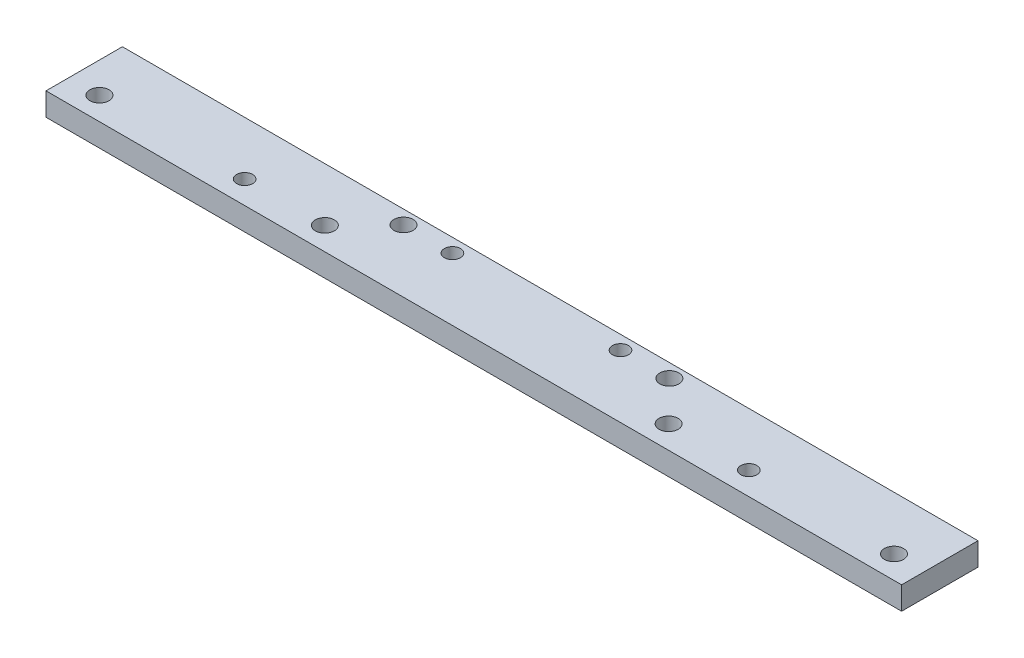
ISO-10303-21;
HEADER;
FILE_DESCRIPTION(('STEP AP214'),'2;1');
FILE_NAME('part.step','',(''),(''),'','','');
FILE_SCHEMA(('AUTOMOTIVE_DESIGN { 1 0 10303 214 1 1 1 1 }'));
ENDSEC;
DATA;
#1=APPLICATION_CONTEXT('core data for automotive mechanical design processes');
#2=APPLICATION_PROTOCOL_DEFINITION('international standard','automotive_design',2000,#1);
#3=PRODUCT_CONTEXT('',#1,'mechanical');
#4=PRODUCT('Part','Part','',(#3));
#5=PRODUCT_RELATED_PRODUCT_CATEGORY('part','',(#4));
#6=PRODUCT_DEFINITION_FORMATION('','',#4);
#7=PRODUCT_DEFINITION_CONTEXT('part definition',#1,'design');
#8=PRODUCT_DEFINITION('design','',#6,#7);
#9=PRODUCT_DEFINITION_SHAPE('','',#8);
#10=(LENGTH_UNIT() NAMED_UNIT(*) SI_UNIT(.MILLI.,.METRE.));
#11=(NAMED_UNIT(*) PLANE_ANGLE_UNIT() SI_UNIT($,.RADIAN.));
#12=(NAMED_UNIT(*) SI_UNIT($,.STERADIAN.) SOLID_ANGLE_UNIT());
#13=UNCERTAINTY_MEASURE_WITH_UNIT(LENGTH_MEASURE(1.E-05),#10,'distance_accuracy_value','');
#14=(GEOMETRIC_REPRESENTATION_CONTEXT(3) GLOBAL_UNCERTAINTY_ASSIGNED_CONTEXT((#13)) GLOBAL_UNIT_ASSIGNED_CONTEXT((#10,
#11,#12)) REPRESENTATION_CONTEXT('',''));
#15=CARTESIAN_POINT('',(0.,0.,0.));
#16=DIRECTION('',(0.,0.,1.));
#17=DIRECTION('',(1.,0.,0.));
#18=AXIS2_PLACEMENT_3D('',#15,#16,#17);
#19=CARTESIAN_POINT('',(280.,15.,25.));
#20=DIRECTION('',(0.,0.,-1.));
#21=DIRECTION('',(0.,1.,0.));
#22=AXIS2_PLACEMENT_3D('',#19,#20,#21);
#23=PLANE('',#22);
#24=DIRECTION('',(0.,-1.,0.));
#25=VECTOR('',#24,1.);
#26=CARTESIAN_POINT('',(-280.,15.,25.));
#27=LINE('',#26,#25);
#28=CARTESIAN_POINT('',(-280.,15.,25.));
#29=VERTEX_POINT('',#28);
#30=CARTESIAN_POINT('',(-280.,0.,25.));
#31=VERTEX_POINT('',#30);
#32=EDGE_CURVE('E83',#29,#31,#27,.T.);
#33=ORIENTED_EDGE('',*,*,#32,.T.);
#34=DIRECTION('',(-1.,0.,0.));
#35=VECTOR('',#34,1.);
#36=CARTESIAN_POINT('',(280.,0.,25.));
#37=LINE('',#36,#35);
#38=CARTESIAN_POINT('',(280.,0.,25.));
#39=VERTEX_POINT('',#38);
#40=EDGE_CURVE('E11',#39,#31,#37,.T.);
#41=ORIENTED_EDGE('',*,*,#40,.F.);
#42=DIRECTION('',(0.,-1.,0.));
#43=VECTOR('',#42,1.);
#44=CARTESIAN_POINT('',(280.,15.,25.));
#45=LINE('',#44,#43);
#46=CARTESIAN_POINT('',(280.,15.,25.));
#47=VERTEX_POINT('',#46);
#48=EDGE_CURVE('E113',#47,#39,#45,.T.);
#49=ORIENTED_EDGE('',*,*,#48,.F.);
#50=DIRECTION('',(-1.,0.,0.));
#51=VECTOR('',#50,1.);
#52=CARTESIAN_POINT('',(280.,15.,25.));
#53=LINE('',#52,#51);
#54=EDGE_CURVE('E96',#47,#29,#53,.T.);
#55=ORIENTED_EDGE('',*,*,#54,.T.);
#56=EDGE_LOOP('',(#33,#41,#49,#55));
#57=FACE_BOUND('',#56,.T.);
#58=ADVANCED_FACE('F38',(#57),#23,.F.);
#59=CARTESIAN_POINT('',(280.,0.,25.));
#60=DIRECTION('',(0.,1.,0.));
#61=DIRECTION('',(0.,0.,1.));
#62=AXIS2_PLACEMENT_3D('',#59,#60,#61);
#63=PLANE('',#62);
#64=CARTESIAN_POINT('',(-260.,0.,10.));
#65=DIRECTION('',(0.,1.,0.));
#66=DIRECTION('',(0.,0.,1.));
#67=AXIS2_PLACEMENT_3D('',#64,#65,#66);
#68=CIRCLE('',#67,6.25);
#69=CARTESIAN_POINT('',(-260.,0.,16.25));
#70=VERTEX_POINT('',#69);
#71=EDGE_CURVE('E155',#70,#70,#68,.F.);
#72=ORIENTED_EDGE('',*,*,#71,.F.);
#73=EDGE_LOOP('',(#72));
#74=FACE_BOUND('',#73,.T.);
#75=CARTESIAN_POINT('',(260.,0.,10.));
#76=DIRECTION('',(0.,1.,0.));
#77=DIRECTION('',(0.,0.,1.));
#78=AXIS2_PLACEMENT_3D('',#75,#76,#77);
#79=CIRCLE('',#78,6.25);
#80=CARTESIAN_POINT('',(260.,0.,16.25));
#81=VERTEX_POINT('',#80);
#82=EDGE_CURVE('E159',#81,#81,#79,.F.);
#83=ORIENTED_EDGE('',*,*,#82,.F.);
#84=EDGE_LOOP('',(#83));
#85=FACE_BOUND('',#84,.T.);
#86=CARTESIAN_POINT('',(-165.,0.,10.));
#87=DIRECTION('',(0.,1.,0.));
#88=DIRECTION('',(0.,0.,1.));
#89=AXIS2_PLACEMENT_3D('',#86,#87,#88);
#90=CIRCLE('',#89,5.25);
#91=CARTESIAN_POINT('',(-165.,0.,15.25));
#92=VERTEX_POINT('',#91);
#93=EDGE_CURVE('E163',#92,#92,#90,.F.);
#94=ORIENTED_EDGE('',*,*,#93,.F.);
#95=EDGE_LOOP('',(#94));
#96=FACE_BOUND('',#95,.T.);
#97=CARTESIAN_POINT('',(165.,0.,10.));
#98=DIRECTION('',(0.,1.,0.));
#99=DIRECTION('',(0.,0.,1.));
#100=AXIS2_PLACEMENT_3D('',#97,#98,#99);
#101=CIRCLE('',#100,5.25);
#102=CARTESIAN_POINT('',(165.,0.,15.25));
#103=VERTEX_POINT('',#102);
#104=EDGE_CURVE('E167',#103,#103,#101,.F.);
#105=ORIENTED_EDGE('',*,*,#104,.F.);
#106=EDGE_LOOP('',(#105));
#107=FACE_BOUND('',#106,.T.);
#108=CARTESIAN_POINT('',(-112.5,0.,10.));
#109=DIRECTION('',(0.,1.,0.));
#110=DIRECTION('',(0.,0.,1.));
#111=AXIS2_PLACEMENT_3D('',#108,#109,#110);
#112=CIRCLE('',#111,6.25);
#113=CARTESIAN_POINT('',(-112.5,0.,16.25));
#114=VERTEX_POINT('',#113);
#115=EDGE_CURVE('E171',#114,#114,#112,.F.);
#116=ORIENTED_EDGE('',*,*,#115,.F.);
#117=EDGE_LOOP('',(#116));
#118=FACE_BOUND('',#117,.T.);
#119=CARTESIAN_POINT('',(112.5,0.,10.));
#120=DIRECTION('',(0.,1.,0.));
#121=DIRECTION('',(0.,0.,1.));
#122=AXIS2_PLACEMENT_3D('',#119,#120,#121);
#123=CIRCLE('',#122,6.25);
#124=CARTESIAN_POINT('',(112.5,0.,16.25));
#125=VERTEX_POINT('',#124);
#126=EDGE_CURVE('E175',#125,#125,#123,.F.);
#127=ORIENTED_EDGE('',*,*,#126,.F.);
#128=EDGE_LOOP('',(#127));
#129=FACE_BOUND('',#128,.T.);
#130=CARTESIAN_POINT('',(-87.,0.,-16.));
#131=DIRECTION('',(0.,1.,0.));
#132=DIRECTION('',(0.,0.,1.));
#133=AXIS2_PLACEMENT_3D('',#130,#131,#132);
#134=CIRCLE('',#133,6.25);
#135=CARTESIAN_POINT('',(-87.,0.,-9.75));
#136=VERTEX_POINT('',#135);
#137=EDGE_CURVE('E179',#136,#136,#134,.F.);
#138=ORIENTED_EDGE('',*,*,#137,.F.);
#139=EDGE_LOOP('',(#138));
#140=FACE_BOUND('',#139,.T.);
#141=CARTESIAN_POINT('',(87.,0.,-16.));
#142=DIRECTION('',(0.,1.,0.));
#143=DIRECTION('',(0.,0.,1.));
#144=AXIS2_PLACEMENT_3D('',#141,#142,#143);
#145=CIRCLE('',#144,6.25);
#146=CARTESIAN_POINT('',(87.,0.,-9.75));
#147=VERTEX_POINT('',#146);
#148=EDGE_CURVE('E183',#147,#147,#145,.F.);
#149=ORIENTED_EDGE('',*,*,#148,.F.);
#150=EDGE_LOOP('',(#149));
#151=FACE_BOUND('',#150,.T.);
#152=CARTESIAN_POINT('',(-55.,0.,-16.));
#153=DIRECTION('',(0.,1.,0.));
#154=DIRECTION('',(0.,0.,1.));
#155=AXIS2_PLACEMENT_3D('',#152,#153,#154);
#156=CIRCLE('',#155,5.25);
#157=CARTESIAN_POINT('',(-55.,0.,-10.75));
#158=VERTEX_POINT('',#157);
#159=EDGE_CURVE('E187',#158,#158,#156,.F.);
#160=ORIENTED_EDGE('',*,*,#159,.F.);
#161=EDGE_LOOP('',(#160));
#162=FACE_BOUND('',#161,.T.);
#163=CARTESIAN_POINT('',(55.,0.,-16.));
#164=DIRECTION('',(0.,1.,0.));
#165=DIRECTION('',(0.,0.,1.));
#166=AXIS2_PLACEMENT_3D('',#163,#164,#165);
#167=CIRCLE('',#166,5.25);
#168=CARTESIAN_POINT('',(55.,0.,-10.75));
#169=VERTEX_POINT('',#168);
#170=EDGE_CURVE('E98',#169,#169,#167,.F.);
#171=ORIENTED_EDGE('',*,*,#170,.F.);
#172=EDGE_LOOP('',(#171));
#173=FACE_BOUND('',#172,.T.);
#174=DIRECTION('',(0.,0.,-1.));
#175=VECTOR('',#174,1.);
#176=CARTESIAN_POINT('',(-280.,0.,25.));
#177=LINE('',#176,#175);
#178=CARTESIAN_POINT('',(-280.,0.,-25.));
#179=VERTEX_POINT('',#178);
#180=EDGE_CURVE('E79',#31,#179,#177,.T.);
#181=ORIENTED_EDGE('',*,*,#180,.T.);
#182=DIRECTION('',(-1.,0.,0.));
#183=VECTOR('',#182,1.);
#184=CARTESIAN_POINT('',(280.,0.,-25.));
#185=LINE('',#184,#183);
#186=CARTESIAN_POINT('',(280.,0.,-25.));
#187=VERTEX_POINT('',#186);
#188=EDGE_CURVE('E46',#187,#179,#185,.T.);
#189=ORIENTED_EDGE('',*,*,#188,.F.);
#190=DIRECTION('',(0.,0.,-1.));
#191=VECTOR('',#190,1.);
#192=CARTESIAN_POINT('',(280.,0.,25.));
#193=LINE('',#192,#191);
#194=EDGE_CURVE('E92',#39,#187,#193,.T.);
#195=ORIENTED_EDGE('',*,*,#194,.F.);
#196=ORIENTED_EDGE('',*,*,#40,.T.);
#197=EDGE_LOOP('',(#181,#189,#195,#196));
#198=FACE_BOUND('',#197,.T.);
#199=ADVANCED_FACE('F91',(#74,#85,#96,#107,#118,#129,#140,#151,#162,#173,#198),#63,.F.);
#200=CARTESIAN_POINT('',(280.,15.,-25.));
#201=DIRECTION('',(0.,0.,1.));
#202=DIRECTION('',(0.,-1.,0.));
#203=AXIS2_PLACEMENT_3D('',#200,#201,#202);
#204=PLANE('',#203);
#205=DIRECTION('',(0.,1.,0.));
#206=VECTOR('',#205,1.);
#207=CARTESIAN_POINT('',(-280.,15.,-25.));
#208=LINE('',#207,#206);
#209=CARTESIAN_POINT('',(-280.,15.,-25.));
#210=VERTEX_POINT('',#209);
#211=EDGE_CURVE('E84',#179,#210,#208,.T.);
#212=ORIENTED_EDGE('',*,*,#211,.T.);
#213=DIRECTION('',(-1.,0.,0.));
#214=VECTOR('',#213,1.);
#215=CARTESIAN_POINT('',(280.,15.,-25.));
#216=LINE('',#215,#214);
#217=CARTESIAN_POINT('',(280.,15.,-25.));
#218=VERTEX_POINT('',#217);
#219=EDGE_CURVE('E124',#218,#210,#216,.T.);
#220=ORIENTED_EDGE('',*,*,#219,.F.);
#221=DIRECTION('',(0.,1.,0.));
#222=VECTOR('',#221,1.);
#223=CARTESIAN_POINT('',(280.,15.,-25.));
#224=LINE('',#223,#222);
#225=EDGE_CURVE('E58',#187,#218,#224,.T.);
#226=ORIENTED_EDGE('',*,*,#225,.F.);
#227=ORIENTED_EDGE('',*,*,#188,.T.);
#228=EDGE_LOOP('',(#212,#220,#226,#227));
#229=FACE_BOUND('',#228,.T.);
#230=ADVANCED_FACE('F129',(#229),#204,.F.);
#231=CARTESIAN_POINT('',(280.,15.,25.));
#232=DIRECTION('',(0.,-1.,0.));
#233=DIRECTION('',(0.,0.,-1.));
#234=AXIS2_PLACEMENT_3D('',#231,#232,#233);
#235=PLANE('',#234);
#236=CARTESIAN_POINT('',(-260.,15.,10.));
#237=DIRECTION('',(0.,1.,0.));
#238=DIRECTION('',(0.,0.,-1.));
#239=AXIS2_PLACEMENT_3D('',#236,#237,#238);
#240=CIRCLE('',#239,6.25);
#241=CARTESIAN_POINT('',(-260.,15.,16.25));
#242=VERTEX_POINT('',#241);
#243=EDGE_CURVE('E237',#242,#242,#240,.T.);
#244=ORIENTED_EDGE('',*,*,#243,.F.);
#245=EDGE_LOOP('',(#244));
#246=FACE_BOUND('',#245,.T.);
#247=CARTESIAN_POINT('',(260.,15.,10.));
#248=DIRECTION('',(0.,1.,0.));
#249=DIRECTION('',(0.,0.,1.));
#250=AXIS2_PLACEMENT_3D('',#247,#248,#249);
#251=CIRCLE('',#250,6.25);
#252=CARTESIAN_POINT('',(260.,15.,16.25));
#253=VERTEX_POINT('',#252);
#254=EDGE_CURVE('E238',#253,#253,#251,.T.);
#255=ORIENTED_EDGE('',*,*,#254,.F.);
#256=EDGE_LOOP('',(#255));
#257=FACE_BOUND('',#256,.T.);
#258=CARTESIAN_POINT('',(-165.,15.,10.));
#259=DIRECTION('',(0.,1.,0.));
#260=DIRECTION('',(0.,0.,-1.));
#261=AXIS2_PLACEMENT_3D('',#258,#259,#260);
#262=CIRCLE('',#261,5.25);
#263=CARTESIAN_POINT('',(-165.,15.,15.25));
#264=VERTEX_POINT('',#263);
#265=EDGE_CURVE('E248',#264,#264,#262,.T.);
#266=ORIENTED_EDGE('',*,*,#265,.F.);
#267=EDGE_LOOP('',(#266));
#268=FACE_BOUND('',#267,.T.);
#269=CARTESIAN_POINT('',(165.,15.,10.));
#270=DIRECTION('',(0.,1.,0.));
#271=DIRECTION('',(0.,0.,1.));
#272=AXIS2_PLACEMENT_3D('',#269,#270,#271);
#273=CIRCLE('',#272,5.25);
#274=CARTESIAN_POINT('',(165.,15.,15.25));
#275=VERTEX_POINT('',#274);
#276=EDGE_CURVE('E254',#275,#275,#273,.T.);
#277=ORIENTED_EDGE('',*,*,#276,.F.);
#278=EDGE_LOOP('',(#277));
#279=FACE_BOUND('',#278,.T.);
#280=CARTESIAN_POINT('',(-112.5,15.,10.));
#281=DIRECTION('',(0.,1.,0.));
#282=DIRECTION('',(0.,0.,-1.));
#283=AXIS2_PLACEMENT_3D('',#280,#281,#282);
#284=CIRCLE('',#283,6.25);
#285=CARTESIAN_POINT('',(-112.5,15.,16.25));
#286=VERTEX_POINT('',#285);
#287=EDGE_CURVE('E260',#286,#286,#284,.T.);
#288=ORIENTED_EDGE('',*,*,#287,.F.);
#289=EDGE_LOOP('',(#288));
#290=FACE_BOUND('',#289,.T.);
#291=CARTESIAN_POINT('',(112.5,15.,10.));
#292=DIRECTION('',(0.,1.,0.));
#293=DIRECTION('',(0.,0.,1.));
#294=AXIS2_PLACEMENT_3D('',#291,#292,#293);
#295=CIRCLE('',#294,6.25);
#296=CARTESIAN_POINT('',(112.5,15.,16.25));
#297=VERTEX_POINT('',#296);
#298=EDGE_CURVE('E265',#297,#297,#295,.T.);
#299=ORIENTED_EDGE('',*,*,#298,.F.);
#300=EDGE_LOOP('',(#299));
#301=FACE_BOUND('',#300,.T.);
#302=CARTESIAN_POINT('',(-87.,15.,-16.));
#303=DIRECTION('',(0.,1.,0.));
#304=DIRECTION('',(0.,0.,-1.));
#305=AXIS2_PLACEMENT_3D('',#302,#303,#304);
#306=CIRCLE('',#305,6.25);
#307=CARTESIAN_POINT('',(-87.,15.,-9.75));
#308=VERTEX_POINT('',#307);
#309=EDGE_CURVE('E271',#308,#308,#306,.T.);
#310=ORIENTED_EDGE('',*,*,#309,.F.);
#311=EDGE_LOOP('',(#310));
#312=FACE_BOUND('',#311,.T.);
#313=CARTESIAN_POINT('',(87.,15.,-16.));
#314=DIRECTION('',(0.,1.,0.));
#315=DIRECTION('',(0.,0.,1.));
#316=AXIS2_PLACEMENT_3D('',#313,#314,#315);
#317=CIRCLE('',#316,6.25);
#318=CARTESIAN_POINT('',(87.,15.,-9.75));
#319=VERTEX_POINT('',#318);
#320=EDGE_CURVE('E277',#319,#319,#317,.T.);
#321=ORIENTED_EDGE('',*,*,#320,.F.);
#322=EDGE_LOOP('',(#321));
#323=FACE_BOUND('',#322,.T.);
#324=CARTESIAN_POINT('',(-55.,15.,-16.));
#325=DIRECTION('',(0.,1.,0.));
#326=DIRECTION('',(0.,0.,-1.));
#327=AXIS2_PLACEMENT_3D('',#324,#325,#326);
#328=CIRCLE('',#327,5.25);
#329=CARTESIAN_POINT('',(-55.,15.,-10.75));
#330=VERTEX_POINT('',#329);
#331=EDGE_CURVE('E283',#330,#330,#328,.T.);
#332=ORIENTED_EDGE('',*,*,#331,.F.);
#333=EDGE_LOOP('',(#332));
#334=FACE_BOUND('',#333,.T.);
#335=CARTESIAN_POINT('',(55.,15.,-16.));
#336=DIRECTION('',(0.,1.,0.));
#337=DIRECTION('',(0.,0.,1.));
#338=AXIS2_PLACEMENT_3D('',#335,#336,#337);
#339=CIRCLE('',#338,5.25);
#340=CARTESIAN_POINT('',(55.,15.,-10.75));
#341=VERTEX_POINT('',#340);
#342=EDGE_CURVE('E104',#341,#341,#339,.T.);
#343=ORIENTED_EDGE('',*,*,#342,.F.);
#344=EDGE_LOOP('',(#343));
#345=FACE_BOUND('',#344,.T.);
#346=DIRECTION('',(0.,0.,1.));
#347=VECTOR('',#346,1.);
#348=CARTESIAN_POINT('',(-280.,15.,25.));
#349=LINE('',#348,#347);
#350=EDGE_CURVE('E110',#210,#29,#349,.T.);
#351=ORIENTED_EDGE('',*,*,#350,.T.);
#352=ORIENTED_EDGE('',*,*,#54,.F.);
#353=DIRECTION('',(0.,0.,1.));
#354=VECTOR('',#353,1.);
#355=CARTESIAN_POINT('',(280.,15.,25.));
#356=LINE('',#355,#354);
#357=EDGE_CURVE('E53',#218,#47,#356,.T.);
#358=ORIENTED_EDGE('',*,*,#357,.F.);
#359=ORIENTED_EDGE('',*,*,#219,.T.);
#360=EDGE_LOOP('',(#351,#352,#358,#359));
#361=FACE_BOUND('',#360,.T.);
#362=ADVANCED_FACE('F131',(#246,#257,#268,#279,#290,#301,#312,#323,#334,#345,#361),#235,.F.);
#363=CARTESIAN_POINT('',(280.,0.,25.));
#364=DIRECTION('',(1.,0.,0.));
#365=DIRECTION('',(0.,0.,-1.));
#366=AXIS2_PLACEMENT_3D('',#363,#364,#365);
#367=PLANE('',#366);
#368=ORIENTED_EDGE('',*,*,#48,.T.);
#369=ORIENTED_EDGE('',*,*,#194,.T.);
#370=ORIENTED_EDGE('',*,*,#225,.T.);
#371=ORIENTED_EDGE('',*,*,#357,.T.);
#372=EDGE_LOOP('',(#368,#369,#370,#371));
#373=FACE_BOUND('',#372,.T.);
#374=ADVANCED_FACE('F132',(#373),#367,.T.);
#375=CARTESIAN_POINT('',(-280.,0.,25.));
#376=DIRECTION('',(1.,0.,0.));
#377=DIRECTION('',(0.,0.,-1.));
#378=AXIS2_PLACEMENT_3D('',#375,#376,#377);
#379=PLANE('',#378);
#380=ORIENTED_EDGE('',*,*,#32,.F.);
#381=ORIENTED_EDGE('',*,*,#350,.F.);
#382=ORIENTED_EDGE('',*,*,#211,.F.);
#383=ORIENTED_EDGE('',*,*,#180,.F.);
#384=EDGE_LOOP('',(#380,#381,#382,#383));
#385=FACE_BOUND('',#384,.T.);
#386=ADVANCED_FACE('F80',(#385),#379,.F.);
#387=CARTESIAN_POINT('',(55.,-0.00100000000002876,-16.));
#388=DIRECTION('',(0.,1.,0.));
#389=DIRECTION('',(0.,0.,1.));
#390=AXIS2_PLACEMENT_3D('',#387,#388,#389);
#391=CYLINDRICAL_SURFACE('',#390,5.25);
#392=CARTESIAN_POINT('',(55.,15.,-10.75));
#393=CARTESIAN_POINT('',(55.,14.84375,-10.75));
#394=CARTESIAN_POINT('',(55.,14.6875,-10.75));
#395=CARTESIAN_POINT('',(55.,14.375,-10.75));
#396=CARTESIAN_POINT('',(55.,14.21875,-10.75));
#397=CARTESIAN_POINT('',(55.,13.90625,-10.75));
#398=CARTESIAN_POINT('',(55.,13.75,-10.75));
#399=CARTESIAN_POINT('',(55.,13.4375,-10.75));
#400=CARTESIAN_POINT('',(55.,13.28125,-10.75));
#401=CARTESIAN_POINT('',(55.,12.96875,-10.75));
#402=CARTESIAN_POINT('',(55.,12.8125,-10.75));
#403=CARTESIAN_POINT('',(55.,12.5,-10.75));
#404=CARTESIAN_POINT('',(55.,12.34375,-10.75));
#405=CARTESIAN_POINT('',(55.,12.03125,-10.75));
#406=CARTESIAN_POINT('',(55.,11.875,-10.75));
#407=CARTESIAN_POINT('',(55.,11.5625,-10.75));
#408=CARTESIAN_POINT('',(55.,11.40625,-10.75));
#409=CARTESIAN_POINT('',(55.,11.09375,-10.75));
#410=CARTESIAN_POINT('',(55.,10.9375,-10.75));
#411=CARTESIAN_POINT('',(55.,10.625,-10.75));
#412=CARTESIAN_POINT('',(55.,10.46875,-10.75));
#413=CARTESIAN_POINT('',(55.,10.15625,-10.75));
#414=CARTESIAN_POINT('',(55.,10.,-10.75));
#415=CARTESIAN_POINT('',(55.,9.68750000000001,-10.75));
#416=CARTESIAN_POINT('',(55.,9.53125000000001,-10.75));
#417=CARTESIAN_POINT('',(55.,9.21875000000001,-10.75));
#418=CARTESIAN_POINT('',(55.,9.06250000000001,-10.75));
#419=CARTESIAN_POINT('',(55.,8.75000000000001,-10.75));
#420=CARTESIAN_POINT('',(55.,8.59375000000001,-10.75));
#421=CARTESIAN_POINT('',(55.,8.28125000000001,-10.75));
#422=CARTESIAN_POINT('',(55.,8.12500000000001,-10.75));
#423=CARTESIAN_POINT('',(55.,7.81250000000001,-10.75));
#424=CARTESIAN_POINT('',(55.,7.65625000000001,-10.75));
#425=CARTESIAN_POINT('',(55.,7.34375000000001,-10.75));
#426=CARTESIAN_POINT('',(55.,7.18750000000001,-10.75));
#427=CARTESIAN_POINT('',(55.,6.87500000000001,-10.75));
#428=CARTESIAN_POINT('',(55.,6.71875000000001,-10.75));
#429=CARTESIAN_POINT('',(55.,6.40625,-10.75));
#430=CARTESIAN_POINT('',(55.,6.25,-10.75));
#431=CARTESIAN_POINT('',(55.,5.9375,-10.75));
#432=CARTESIAN_POINT('',(55.,5.78125,-10.75));
#433=CARTESIAN_POINT('',(55.,5.46875,-10.75));
#434=CARTESIAN_POINT('',(55.,5.3125,-10.75));
#435=CARTESIAN_POINT('',(55.,5.,-10.75));
#436=CARTESIAN_POINT('',(55.,4.84375,-10.75));
#437=CARTESIAN_POINT('',(55.,4.53125,-10.75));
#438=CARTESIAN_POINT('',(55.,4.375,-10.75));
#439=CARTESIAN_POINT('',(55.,4.0625,-10.75));
#440=CARTESIAN_POINT('',(55.,3.90625,-10.75));
#441=CARTESIAN_POINT('',(55.,3.59375,-10.75));
#442=CARTESIAN_POINT('',(55.,3.4375,-10.75));
#443=CARTESIAN_POINT('',(55.,3.125,-10.75));
#444=CARTESIAN_POINT('',(55.,2.96875,-10.75));
#445=CARTESIAN_POINT('',(55.,2.65625,-10.75));
#446=CARTESIAN_POINT('',(55.,2.5,-10.75));
#447=CARTESIAN_POINT('',(55.,2.1875,-10.75));
#448=CARTESIAN_POINT('',(55.,2.03125,-10.75));
#449=CARTESIAN_POINT('',(55.,1.71875,-10.75));
#450=CARTESIAN_POINT('',(55.,1.5625,-10.75));
#451=CARTESIAN_POINT('',(55.,1.25,-10.75));
#452=CARTESIAN_POINT('',(55.,1.09375,-10.75));
#453=CARTESIAN_POINT('',(55.,0.781250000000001,-10.75));
#454=CARTESIAN_POINT('',(55.,0.625000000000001,-10.75));
#455=CARTESIAN_POINT('',(55.,0.3125,-10.75));
#456=CARTESIAN_POINT('',(55.,0.15625,-10.75));
#457=CARTESIAN_POINT('',(55.,0.,-10.75));
#458=B_SPLINE_CURVE_WITH_KNOTS('',3,(#392,#393,#394,#395,#396,#397,#398,#399,#400,#401,#402,
#403,#404,#405,#406,#407,#408,#409,#410,#411,#412,#413,#414,#415,#416,#417,#418,#419,#420,#421,
#422,#423,#424,#425,#426,#427,#428,#429,#430,#431,#432,#433,#434,#435,#436,#437,#438,#439,#440,
#441,#442,#443,#444,#445,#446,#447,#448,#449,#450,#451,#452,#453,#454,#455,#456,#457),
.UNSPECIFIED.,.F.,.F.,(4,2,2,2,2,2,2,2,2,2,2,2,2,2,2,2,2,2,2,2,2,2,2,2,2,2,2,2,2,2,2,2,4),(0.,
0.46875,0.937500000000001,1.40625,1.875,2.34375,2.8125,3.28125,3.75,4.21875,4.6875,5.15625,
5.62500000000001,6.09375000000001,6.56250000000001,7.03125000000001,7.50000000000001,
7.96875000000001,8.43750000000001,8.90625000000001,9.37500000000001,9.84375000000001,10.3125,
10.78125,11.25,11.71875,12.1875,12.65625,13.125,13.59375,14.0625,14.53125,15.),.UNSPECIFIED.);
#459=EDGE_CURVE('BSEAM139',#341,#169,#458,.T.);
#460=ORIENTED_EDGE('',*,*,#342,.T.);
#461=ORIENTED_EDGE('',*,*,#170,.T.);
#462=ORIENTED_EDGE('',*,*,#459,.T.);
#463=ORIENTED_EDGE('',*,*,#459,.F.);
#464=EDGE_LOOP('',(#460,#462,#461,#463));
#465=FACE_BOUND('',#464,.T.);
#466=ADVANCED_FACE('F139',(#465),#391,.F.);
#467=CARTESIAN_POINT('',(-55.,-0.00100000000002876,-16.));
#468=DIRECTION('',(0.,1.,0.));
#469=DIRECTION('',(0.,0.,1.));
#470=AXIS2_PLACEMENT_3D('',#467,#468,#469);
#471=CYLINDRICAL_SURFACE('',#470,5.25);
#472=CARTESIAN_POINT('',(-55.,15.,-10.75));
#473=CARTESIAN_POINT('',(-55.,14.84375,-10.75));
#474=CARTESIAN_POINT('',(-55.,14.6875,-10.75));
#475=CARTESIAN_POINT('',(-55.,14.375,-10.75));
#476=CARTESIAN_POINT('',(-55.,14.21875,-10.75));
#477=CARTESIAN_POINT('',(-55.,13.90625,-10.75));
#478=CARTESIAN_POINT('',(-55.,13.75,-10.75));
#479=CARTESIAN_POINT('',(-55.,13.4375,-10.75));
#480=CARTESIAN_POINT('',(-55.,13.28125,-10.75));
#481=CARTESIAN_POINT('',(-55.,12.96875,-10.75));
#482=CARTESIAN_POINT('',(-55.,12.8125,-10.75));
#483=CARTESIAN_POINT('',(-55.,12.5,-10.75));
#484=CARTESIAN_POINT('',(-55.,12.34375,-10.75));
#485=CARTESIAN_POINT('',(-55.,12.03125,-10.75));
#486=CARTESIAN_POINT('',(-55.,11.875,-10.75));
#487=CARTESIAN_POINT('',(-55.,11.5625,-10.75));
#488=CARTESIAN_POINT('',(-55.,11.40625,-10.75));
#489=CARTESIAN_POINT('',(-55.,11.09375,-10.75));
#490=CARTESIAN_POINT('',(-55.,10.9375,-10.75));
#491=CARTESIAN_POINT('',(-55.,10.625,-10.75));
#492=CARTESIAN_POINT('',(-55.,10.46875,-10.75));
#493=CARTESIAN_POINT('',(-55.,10.15625,-10.75));
#494=CARTESIAN_POINT('',(-55.,10.,-10.75));
#495=CARTESIAN_POINT('',(-55.,9.68750000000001,-10.75));
#496=CARTESIAN_POINT('',(-55.,9.53125000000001,-10.75));
#497=CARTESIAN_POINT('',(-55.,9.21875000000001,-10.75));
#498=CARTESIAN_POINT('',(-55.,9.06250000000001,-10.75));
#499=CARTESIAN_POINT('',(-55.,8.75000000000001,-10.75));
#500=CARTESIAN_POINT('',(-55.,8.59375000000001,-10.75));
#501=CARTESIAN_POINT('',(-55.,8.28125000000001,-10.75));
#502=CARTESIAN_POINT('',(-55.,8.12500000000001,-10.75));
#503=CARTESIAN_POINT('',(-55.,7.81250000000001,-10.75));
#504=CARTESIAN_POINT('',(-55.,7.65625000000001,-10.75));
#505=CARTESIAN_POINT('',(-55.,7.34375000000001,-10.75));
#506=CARTESIAN_POINT('',(-55.,7.18750000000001,-10.75));
#507=CARTESIAN_POINT('',(-55.,6.87500000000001,-10.75));
#508=CARTESIAN_POINT('',(-55.,6.71875000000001,-10.75));
#509=CARTESIAN_POINT('',(-55.,6.40625,-10.75));
#510=CARTESIAN_POINT('',(-55.,6.25,-10.75));
#511=CARTESIAN_POINT('',(-55.,5.9375,-10.75));
#512=CARTESIAN_POINT('',(-55.,5.78125,-10.75));
#513=CARTESIAN_POINT('',(-55.,5.46875,-10.75));
#514=CARTESIAN_POINT('',(-55.,5.3125,-10.75));
#515=CARTESIAN_POINT('',(-55.,5.,-10.75));
#516=CARTESIAN_POINT('',(-55.,4.84375,-10.75));
#517=CARTESIAN_POINT('',(-55.,4.53125,-10.75));
#518=CARTESIAN_POINT('',(-55.,4.375,-10.75));
#519=CARTESIAN_POINT('',(-55.,4.0625,-10.75));
#520=CARTESIAN_POINT('',(-55.,3.90625,-10.75));
#521=CARTESIAN_POINT('',(-55.,3.59375,-10.75));
#522=CARTESIAN_POINT('',(-55.,3.4375,-10.75));
#523=CARTESIAN_POINT('',(-55.,3.125,-10.75));
#524=CARTESIAN_POINT('',(-55.,2.96875,-10.75));
#525=CARTESIAN_POINT('',(-55.,2.65625,-10.75));
#526=CARTESIAN_POINT('',(-55.,2.5,-10.75));
#527=CARTESIAN_POINT('',(-55.,2.1875,-10.75));
#528=CARTESIAN_POINT('',(-55.,2.03125,-10.75));
#529=CARTESIAN_POINT('',(-55.,1.71875,-10.75));
#530=CARTESIAN_POINT('',(-55.,1.5625,-10.75));
#531=CARTESIAN_POINT('',(-55.,1.25,-10.75));
#532=CARTESIAN_POINT('',(-55.,1.09375,-10.75));
#533=CARTESIAN_POINT('',(-55.,0.781250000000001,-10.75));
#534=CARTESIAN_POINT('',(-55.,0.625000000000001,-10.75));
#535=CARTESIAN_POINT('',(-55.,0.3125,-10.75));
#536=CARTESIAN_POINT('',(-55.,0.15625,-10.75));
#537=CARTESIAN_POINT('',(-55.,0.,-10.75));
#538=B_SPLINE_CURVE_WITH_KNOTS('',3,(#472,#473,#474,#475,#476,#477,#478,#479,#480,#481,#482,
#483,#484,#485,#486,#487,#488,#489,#490,#491,#492,#493,#494,#495,#496,#497,#498,#499,#500,#501,
#502,#503,#504,#505,#506,#507,#508,#509,#510,#511,#512,#513,#514,#515,#516,#517,#518,#519,#520,
#521,#522,#523,#524,#525,#526,#527,#528,#529,#530,#531,#532,#533,#534,#535,#536,#537),
.UNSPECIFIED.,.F.,.F.,(4,2,2,2,2,2,2,2,2,2,2,2,2,2,2,2,2,2,2,2,2,2,2,2,2,2,2,2,2,2,2,2,4),(0.,
0.46875,0.937500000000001,1.40625,1.875,2.34375,2.8125,3.28125,3.75,4.21875,4.6875,5.15625,
5.62500000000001,6.09375000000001,6.56250000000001,7.03125000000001,7.50000000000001,
7.96875000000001,8.43750000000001,8.90625000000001,9.37500000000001,9.84375000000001,10.3125,
10.78125,11.25,11.71875,12.1875,12.65625,13.125,13.59375,14.0625,14.53125,15.),.UNSPECIFIED.);
#539=EDGE_CURVE('BSEAM191',#330,#158,#538,.T.);
#540=ORIENTED_EDGE('',*,*,#331,.T.);
#541=ORIENTED_EDGE('',*,*,#159,.T.);
#542=ORIENTED_EDGE('',*,*,#539,.T.);
#543=ORIENTED_EDGE('',*,*,#539,.F.);
#544=EDGE_LOOP('',(#540,#542,#541,#543));
#545=FACE_BOUND('',#544,.T.);
#546=ADVANCED_FACE('F191',(#545),#471,.F.);
#547=CARTESIAN_POINT('',(87.,-0.00100000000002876,-16.));
#548=DIRECTION('',(0.,1.,0.));
#549=DIRECTION('',(0.,0.,1.));
#550=AXIS2_PLACEMENT_3D('',#547,#548,#549);
#551=CYLINDRICAL_SURFACE('',#550,6.25);
#552=CARTESIAN_POINT('',(87.,15.,-9.75));
#553=CARTESIAN_POINT('',(87.,14.84375,-9.75));
#554=CARTESIAN_POINT('',(87.,14.6875,-9.75));
#555=CARTESIAN_POINT('',(87.,14.375,-9.75));
#556=CARTESIAN_POINT('',(87.,14.21875,-9.75));
#557=CARTESIAN_POINT('',(87.,13.90625,-9.75));
#558=CARTESIAN_POINT('',(87.,13.75,-9.75));
#559=CARTESIAN_POINT('',(87.,13.4375,-9.75));
#560=CARTESIAN_POINT('',(87.,13.28125,-9.75));
#561=CARTESIAN_POINT('',(87.,12.96875,-9.75));
#562=CARTESIAN_POINT('',(87.,12.8125,-9.75));
#563=CARTESIAN_POINT('',(87.,12.5,-9.75));
#564=CARTESIAN_POINT('',(87.,12.34375,-9.75));
#565=CARTESIAN_POINT('',(87.,12.03125,-9.75));
#566=CARTESIAN_POINT('',(87.,11.875,-9.75));
#567=CARTESIAN_POINT('',(87.,11.5625,-9.75));
#568=CARTESIAN_POINT('',(87.,11.40625,-9.75));
#569=CARTESIAN_POINT('',(87.,11.09375,-9.75));
#570=CARTESIAN_POINT('',(87.,10.9375,-9.75));
#571=CARTESIAN_POINT('',(87.,10.625,-9.75));
#572=CARTESIAN_POINT('',(87.,10.46875,-9.75));
#573=CARTESIAN_POINT('',(87.,10.15625,-9.75));
#574=CARTESIAN_POINT('',(87.,10.,-9.75));
#575=CARTESIAN_POINT('',(87.,9.68750000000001,-9.75));
#576=CARTESIAN_POINT('',(87.,9.53125000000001,-9.75));
#577=CARTESIAN_POINT('',(87.,9.21875000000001,-9.75));
#578=CARTESIAN_POINT('',(87.,9.06250000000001,-9.75));
#579=CARTESIAN_POINT('',(87.,8.75000000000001,-9.75));
#580=CARTESIAN_POINT('',(87.,8.59375000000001,-9.75));
#581=CARTESIAN_POINT('',(87.,8.28125000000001,-9.75));
#582=CARTESIAN_POINT('',(87.,8.12500000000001,-9.75));
#583=CARTESIAN_POINT('',(87.,7.81250000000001,-9.75));
#584=CARTESIAN_POINT('',(87.,7.65625000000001,-9.75));
#585=CARTESIAN_POINT('',(87.,7.34375000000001,-9.75));
#586=CARTESIAN_POINT('',(87.,7.18750000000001,-9.75));
#587=CARTESIAN_POINT('',(87.,6.87500000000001,-9.75));
#588=CARTESIAN_POINT('',(87.,6.71875000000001,-9.75));
#589=CARTESIAN_POINT('',(87.,6.40625,-9.75));
#590=CARTESIAN_POINT('',(87.,6.25,-9.75));
#591=CARTESIAN_POINT('',(87.,5.9375,-9.75));
#592=CARTESIAN_POINT('',(87.,5.78125,-9.75));
#593=CARTESIAN_POINT('',(87.,5.46875,-9.75));
#594=CARTESIAN_POINT('',(87.,5.3125,-9.75));
#595=CARTESIAN_POINT('',(87.,5.,-9.75));
#596=CARTESIAN_POINT('',(87.,4.84375,-9.75));
#597=CARTESIAN_POINT('',(87.,4.53125,-9.75));
#598=CARTESIAN_POINT('',(87.,4.375,-9.75));
#599=CARTESIAN_POINT('',(87.,4.0625,-9.75));
#600=CARTESIAN_POINT('',(87.,3.90625,-9.75));
#601=CARTESIAN_POINT('',(87.,3.59375,-9.75));
#602=CARTESIAN_POINT('',(87.,3.4375,-9.75));
#603=CARTESIAN_POINT('',(87.,3.125,-9.75));
#604=CARTESIAN_POINT('',(87.,2.96875,-9.75));
#605=CARTESIAN_POINT('',(87.,2.65625,-9.75));
#606=CARTESIAN_POINT('',(87.,2.5,-9.75));
#607=CARTESIAN_POINT('',(87.,2.1875,-9.75));
#608=CARTESIAN_POINT('',(87.,2.03125,-9.75));
#609=CARTESIAN_POINT('',(87.,1.71875,-9.75));
#610=CARTESIAN_POINT('',(87.,1.5625,-9.75));
#611=CARTESIAN_POINT('',(87.,1.25,-9.75));
#612=CARTESIAN_POINT('',(87.,1.09375,-9.75));
#613=CARTESIAN_POINT('',(87.,0.781250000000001,-9.75));
#614=CARTESIAN_POINT('',(87.,0.625000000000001,-9.75));
#615=CARTESIAN_POINT('',(87.,0.3125,-9.75));
#616=CARTESIAN_POINT('',(87.,0.15625,-9.75));
#617=CARTESIAN_POINT('',(87.,0.,-9.75));
#618=B_SPLINE_CURVE_WITH_KNOTS('',3,(#552,#553,#554,#555,#556,#557,#558,#559,#560,#561,#562,
#563,#564,#565,#566,#567,#568,#569,#570,#571,#572,#573,#574,#575,#576,#577,#578,#579,#580,#581,
#582,#583,#584,#585,#586,#587,#588,#589,#590,#591,#592,#593,#594,#595,#596,#597,#598,#599,#600,
#601,#602,#603,#604,#605,#606,#607,#608,#609,#610,#611,#612,#613,#614,#615,#616,#617),
.UNSPECIFIED.,.F.,.F.,(4,2,2,2,2,2,2,2,2,2,2,2,2,2,2,2,2,2,2,2,2,2,2,2,2,2,2,2,2,2,2,2,4),(0.,
0.46875,0.937500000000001,1.40625,1.875,2.34375,2.8125,3.28125,3.75,4.21875,4.6875,5.15625,
5.62500000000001,6.09375000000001,6.56250000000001,7.03125000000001,7.50000000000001,
7.96875000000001,8.43750000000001,8.90625000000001,9.37500000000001,9.84375000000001,10.3125,
10.78125,11.25,11.71875,12.1875,12.65625,13.125,13.59375,14.0625,14.53125,15.),.UNSPECIFIED.);
#619=EDGE_CURVE('BSEAM197',#319,#147,#618,.T.);
#620=ORIENTED_EDGE('',*,*,#320,.T.);
#621=ORIENTED_EDGE('',*,*,#148,.T.);
#622=ORIENTED_EDGE('',*,*,#619,.T.);
#623=ORIENTED_EDGE('',*,*,#619,.F.);
#624=EDGE_LOOP('',(#620,#622,#621,#623));
#625=FACE_BOUND('',#624,.T.);
#626=ADVANCED_FACE('F197',(#625),#551,.F.);
#627=CARTESIAN_POINT('',(-87.,-0.00100000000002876,-16.));
#628=DIRECTION('',(0.,1.,0.));
#629=DIRECTION('',(0.,0.,1.));
#630=AXIS2_PLACEMENT_3D('',#627,#628,#629);
#631=CYLINDRICAL_SURFACE('',#630,6.25);
#632=CARTESIAN_POINT('',(-87.,15.,-9.75));
#633=CARTESIAN_POINT('',(-87.,14.84375,-9.75));
#634=CARTESIAN_POINT('',(-87.,14.6875,-9.75));
#635=CARTESIAN_POINT('',(-87.,14.375,-9.75));
#636=CARTESIAN_POINT('',(-87.,14.21875,-9.75));
#637=CARTESIAN_POINT('',(-87.,13.90625,-9.75));
#638=CARTESIAN_POINT('',(-87.,13.75,-9.75));
#639=CARTESIAN_POINT('',(-87.,13.4375,-9.75));
#640=CARTESIAN_POINT('',(-87.,13.28125,-9.75));
#641=CARTESIAN_POINT('',(-87.,12.96875,-9.75));
#642=CARTESIAN_POINT('',(-87.,12.8125,-9.75));
#643=CARTESIAN_POINT('',(-87.,12.5,-9.75));
#644=CARTESIAN_POINT('',(-87.,12.34375,-9.75));
#645=CARTESIAN_POINT('',(-87.,12.03125,-9.75));
#646=CARTESIAN_POINT('',(-87.,11.875,-9.75));
#647=CARTESIAN_POINT('',(-87.,11.5625,-9.75));
#648=CARTESIAN_POINT('',(-87.,11.40625,-9.75));
#649=CARTESIAN_POINT('',(-87.,11.09375,-9.75));
#650=CARTESIAN_POINT('',(-87.,10.9375,-9.75));
#651=CARTESIAN_POINT('',(-87.,10.625,-9.75));
#652=CARTESIAN_POINT('',(-87.,10.46875,-9.75));
#653=CARTESIAN_POINT('',(-87.,10.15625,-9.75));
#654=CARTESIAN_POINT('',(-87.,10.,-9.75));
#655=CARTESIAN_POINT('',(-87.,9.68750000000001,-9.75));
#656=CARTESIAN_POINT('',(-87.,9.53125000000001,-9.75));
#657=CARTESIAN_POINT('',(-87.,9.21875000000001,-9.75));
#658=CARTESIAN_POINT('',(-87.,9.06250000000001,-9.75));
#659=CARTESIAN_POINT('',(-87.,8.75000000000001,-9.75));
#660=CARTESIAN_POINT('',(-87.,8.59375000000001,-9.75));
#661=CARTESIAN_POINT('',(-87.,8.28125000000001,-9.75));
#662=CARTESIAN_POINT('',(-87.,8.12500000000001,-9.75));
#663=CARTESIAN_POINT('',(-87.,7.81250000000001,-9.75));
#664=CARTESIAN_POINT('',(-87.,7.65625000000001,-9.75));
#665=CARTESIAN_POINT('',(-87.,7.34375000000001,-9.75));
#666=CARTESIAN_POINT('',(-87.,7.18750000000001,-9.75));
#667=CARTESIAN_POINT('',(-87.,6.87500000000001,-9.75));
#668=CARTESIAN_POINT('',(-87.,6.71875000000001,-9.75));
#669=CARTESIAN_POINT('',(-87.,6.40625,-9.75));
#670=CARTESIAN_POINT('',(-87.,6.25,-9.75));
#671=CARTESIAN_POINT('',(-87.,5.9375,-9.75));
#672=CARTESIAN_POINT('',(-87.,5.78125,-9.75));
#673=CARTESIAN_POINT('',(-87.,5.46875,-9.75));
#674=CARTESIAN_POINT('',(-87.,5.3125,-9.75));
#675=CARTESIAN_POINT('',(-87.,5.,-9.75));
#676=CARTESIAN_POINT('',(-87.,4.84375,-9.75));
#677=CARTESIAN_POINT('',(-87.,4.53125,-9.75));
#678=CARTESIAN_POINT('',(-87.,4.375,-9.75));
#679=CARTESIAN_POINT('',(-87.,4.0625,-9.75));
#680=CARTESIAN_POINT('',(-87.,3.90625,-9.75));
#681=CARTESIAN_POINT('',(-87.,3.59375,-9.75));
#682=CARTESIAN_POINT('',(-87.,3.4375,-9.75));
#683=CARTESIAN_POINT('',(-87.,3.125,-9.75));
#684=CARTESIAN_POINT('',(-87.,2.96875,-9.75));
#685=CARTESIAN_POINT('',(-87.,2.65625,-9.75));
#686=CARTESIAN_POINT('',(-87.,2.5,-9.75));
#687=CARTESIAN_POINT('',(-87.,2.1875,-9.75));
#688=CARTESIAN_POINT('',(-87.,2.03125,-9.75));
#689=CARTESIAN_POINT('',(-87.,1.71875,-9.75));
#690=CARTESIAN_POINT('',(-87.,1.5625,-9.75));
#691=CARTESIAN_POINT('',(-87.,1.25,-9.75));
#692=CARTESIAN_POINT('',(-87.,1.09375,-9.75));
#693=CARTESIAN_POINT('',(-87.,0.781250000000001,-9.75));
#694=CARTESIAN_POINT('',(-87.,0.625000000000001,-9.75));
#695=CARTESIAN_POINT('',(-87.,0.3125,-9.75));
#696=CARTESIAN_POINT('',(-87.,0.15625,-9.75));
#697=CARTESIAN_POINT('',(-87.,0.,-9.75));
#698=B_SPLINE_CURVE_WITH_KNOTS('',3,(#632,#633,#634,#635,#636,#637,#638,#639,#640,#641,#642,
#643,#644,#645,#646,#647,#648,#649,#650,#651,#652,#653,#654,#655,#656,#657,#658,#659,#660,#661,
#662,#663,#664,#665,#666,#667,#668,#669,#670,#671,#672,#673,#674,#675,#676,#677,#678,#679,#680,
#681,#682,#683,#684,#685,#686,#687,#688,#689,#690,#691,#692,#693,#694,#695,#696,#697),
.UNSPECIFIED.,.F.,.F.,(4,2,2,2,2,2,2,2,2,2,2,2,2,2,2,2,2,2,2,2,2,2,2,2,2,2,2,2,2,2,2,2,4),(0.,
0.46875,0.937500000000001,1.40625,1.875,2.34375,2.8125,3.28125,3.75,4.21875,4.6875,5.15625,
5.62500000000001,6.09375000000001,6.56250000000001,7.03125000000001,7.50000000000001,
7.96875000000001,8.43750000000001,8.90625000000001,9.37500000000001,9.84375000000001,10.3125,
10.78125,11.25,11.71875,12.1875,12.65625,13.125,13.59375,14.0625,14.53125,15.),.UNSPECIFIED.);
#699=EDGE_CURVE('BSEAM204',#308,#136,#698,.T.);
#700=ORIENTED_EDGE('',*,*,#309,.T.);
#701=ORIENTED_EDGE('',*,*,#137,.T.);
#702=ORIENTED_EDGE('',*,*,#699,.T.);
#703=ORIENTED_EDGE('',*,*,#699,.F.);
#704=EDGE_LOOP('',(#700,#702,#701,#703));
#705=FACE_BOUND('',#704,.T.);
#706=ADVANCED_FACE('F204',(#705),#631,.F.);
#707=CARTESIAN_POINT('',(112.5,-0.00100000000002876,10.));
#708=DIRECTION('',(0.,1.,0.));
#709=DIRECTION('',(0.,0.,1.));
#710=AXIS2_PLACEMENT_3D('',#707,#708,#709);
#711=CYLINDRICAL_SURFACE('',#710,6.25);
#712=CARTESIAN_POINT('',(112.5,15.,16.25));
#713=CARTESIAN_POINT('',(112.5,14.84375,16.25));
#714=CARTESIAN_POINT('',(112.5,14.6875,16.25));
#715=CARTESIAN_POINT('',(112.5,14.375,16.25));
#716=CARTESIAN_POINT('',(112.5,14.21875,16.25));
#717=CARTESIAN_POINT('',(112.5,13.90625,16.25));
#718=CARTESIAN_POINT('',(112.5,13.75,16.25));
#719=CARTESIAN_POINT('',(112.5,13.4375,16.25));
#720=CARTESIAN_POINT('',(112.5,13.28125,16.25));
#721=CARTESIAN_POINT('',(112.5,12.96875,16.25));
#722=CARTESIAN_POINT('',(112.5,12.8125,16.25));
#723=CARTESIAN_POINT('',(112.5,12.5,16.25));
#724=CARTESIAN_POINT('',(112.5,12.34375,16.25));
#725=CARTESIAN_POINT('',(112.5,12.03125,16.25));
#726=CARTESIAN_POINT('',(112.5,11.875,16.25));
#727=CARTESIAN_POINT('',(112.5,11.5625,16.25));
#728=CARTESIAN_POINT('',(112.5,11.40625,16.25));
#729=CARTESIAN_POINT('',(112.5,11.09375,16.25));
#730=CARTESIAN_POINT('',(112.5,10.9375,16.25));
#731=CARTESIAN_POINT('',(112.5,10.625,16.25));
#732=CARTESIAN_POINT('',(112.5,10.46875,16.25));
#733=CARTESIAN_POINT('',(112.5,10.15625,16.25));
#734=CARTESIAN_POINT('',(112.5,10.,16.25));
#735=CARTESIAN_POINT('',(112.5,9.68750000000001,16.25));
#736=CARTESIAN_POINT('',(112.5,9.53125000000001,16.25));
#737=CARTESIAN_POINT('',(112.5,9.21875000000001,16.25));
#738=CARTESIAN_POINT('',(112.5,9.06250000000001,16.25));
#739=CARTESIAN_POINT('',(112.5,8.75000000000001,16.25));
#740=CARTESIAN_POINT('',(112.5,8.59375000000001,16.25));
#741=CARTESIAN_POINT('',(112.5,8.28125000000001,16.25));
#742=CARTESIAN_POINT('',(112.5,8.12500000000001,16.25));
#743=CARTESIAN_POINT('',(112.5,7.81250000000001,16.25));
#744=CARTESIAN_POINT('',(112.5,7.65625000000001,16.25));
#745=CARTESIAN_POINT('',(112.5,7.34375000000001,16.25));
#746=CARTESIAN_POINT('',(112.5,7.18750000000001,16.25));
#747=CARTESIAN_POINT('',(112.5,6.87500000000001,16.25));
#748=CARTESIAN_POINT('',(112.5,6.71875000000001,16.25));
#749=CARTESIAN_POINT('',(112.5,6.40625,16.25));
#750=CARTESIAN_POINT('',(112.5,6.25,16.25));
#751=CARTESIAN_POINT('',(112.5,5.9375,16.25));
#752=CARTESIAN_POINT('',(112.5,5.78125,16.25));
#753=CARTESIAN_POINT('',(112.5,5.46875,16.25));
#754=CARTESIAN_POINT('',(112.5,5.3125,16.25));
#755=CARTESIAN_POINT('',(112.5,5.,16.25));
#756=CARTESIAN_POINT('',(112.5,4.84375,16.25));
#757=CARTESIAN_POINT('',(112.5,4.53125,16.25));
#758=CARTESIAN_POINT('',(112.5,4.375,16.25));
#759=CARTESIAN_POINT('',(112.5,4.0625,16.25));
#760=CARTESIAN_POINT('',(112.5,3.90625,16.25));
#761=CARTESIAN_POINT('',(112.5,3.59375,16.25));
#762=CARTESIAN_POINT('',(112.5,3.4375,16.25));
#763=CARTESIAN_POINT('',(112.5,3.125,16.25));
#764=CARTESIAN_POINT('',(112.5,2.96875,16.25));
#765=CARTESIAN_POINT('',(112.5,2.65625,16.25));
#766=CARTESIAN_POINT('',(112.5,2.5,16.25));
#767=CARTESIAN_POINT('',(112.5,2.1875,16.25));
#768=CARTESIAN_POINT('',(112.5,2.03125,16.25));
#769=CARTESIAN_POINT('',(112.5,1.71875,16.25));
#770=CARTESIAN_POINT('',(112.5,1.5625,16.25));
#771=CARTESIAN_POINT('',(112.5,1.25,16.25));
#772=CARTESIAN_POINT('',(112.5,1.09375,16.25));
#773=CARTESIAN_POINT('',(112.5,0.781250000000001,16.25));
#774=CARTESIAN_POINT('',(112.5,0.625000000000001,16.25));
#775=CARTESIAN_POINT('',(112.5,0.3125,16.25));
#776=CARTESIAN_POINT('',(112.5,0.15625,16.25));
#777=CARTESIAN_POINT('',(112.5,0.,16.25));
#778=B_SPLINE_CURVE_WITH_KNOTS('',3,(#712,#713,#714,#715,#716,#717,#718,#719,#720,#721,#722,
#723,#724,#725,#726,#727,#728,#729,#730,#731,#732,#733,#734,#735,#736,#737,#738,#739,#740,#741,
#742,#743,#744,#745,#746,#747,#748,#749,#750,#751,#752,#753,#754,#755,#756,#757,#758,#759,#760,
#761,#762,#763,#764,#765,#766,#767,#768,#769,#770,#771,#772,#773,#774,#775,#776,#777),
.UNSPECIFIED.,.F.,.F.,(4,2,2,2,2,2,2,2,2,2,2,2,2,2,2,2,2,2,2,2,2,2,2,2,2,2,2,2,2,2,2,2,4),(0.,
0.46875,0.937500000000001,1.40625,1.875,2.34375,2.8125,3.28125,3.75,4.21875,4.6875,5.15625,
5.62500000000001,6.09375000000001,6.56250000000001,7.03125000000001,7.50000000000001,
7.96875000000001,8.43750000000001,8.90625000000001,9.37500000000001,9.84375000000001,10.3125,
10.78125,11.25,11.71875,12.1875,12.65625,13.125,13.59375,14.0625,14.53125,15.),.UNSPECIFIED.);
#779=EDGE_CURVE('BSEAM208',#297,#125,#778,.T.);
#780=ORIENTED_EDGE('',*,*,#298,.T.);
#781=ORIENTED_EDGE('',*,*,#126,.T.);
#782=ORIENTED_EDGE('',*,*,#779,.T.);
#783=ORIENTED_EDGE('',*,*,#779,.F.);
#784=EDGE_LOOP('',(#780,#782,#781,#783));
#785=FACE_BOUND('',#784,.T.);
#786=ADVANCED_FACE('F208',(#785),#711,.F.);
#787=CARTESIAN_POINT('',(-112.5,-0.00100000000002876,10.));
#788=DIRECTION('',(0.,1.,0.));
#789=DIRECTION('',(0.,0.,1.));
#790=AXIS2_PLACEMENT_3D('',#787,#788,#789);
#791=CYLINDRICAL_SURFACE('',#790,6.25);
#792=CARTESIAN_POINT('',(-112.5,15.,16.25));
#793=CARTESIAN_POINT('',(-112.5,14.84375,16.25));
#794=CARTESIAN_POINT('',(-112.5,14.6875,16.25));
#795=CARTESIAN_POINT('',(-112.5,14.375,16.25));
#796=CARTESIAN_POINT('',(-112.5,14.21875,16.25));
#797=CARTESIAN_POINT('',(-112.5,13.90625,16.25));
#798=CARTESIAN_POINT('',(-112.5,13.75,16.25));
#799=CARTESIAN_POINT('',(-112.5,13.4375,16.25));
#800=CARTESIAN_POINT('',(-112.5,13.28125,16.25));
#801=CARTESIAN_POINT('',(-112.5,12.96875,16.25));
#802=CARTESIAN_POINT('',(-112.5,12.8125,16.25));
#803=CARTESIAN_POINT('',(-112.5,12.5,16.25));
#804=CARTESIAN_POINT('',(-112.5,12.34375,16.25));
#805=CARTESIAN_POINT('',(-112.5,12.03125,16.25));
#806=CARTESIAN_POINT('',(-112.5,11.875,16.25));
#807=CARTESIAN_POINT('',(-112.5,11.5625,16.25));
#808=CARTESIAN_POINT('',(-112.5,11.40625,16.25));
#809=CARTESIAN_POINT('',(-112.5,11.09375,16.25));
#810=CARTESIAN_POINT('',(-112.5,10.9375,16.25));
#811=CARTESIAN_POINT('',(-112.5,10.625,16.25));
#812=CARTESIAN_POINT('',(-112.5,10.46875,16.25));
#813=CARTESIAN_POINT('',(-112.5,10.15625,16.25));
#814=CARTESIAN_POINT('',(-112.5,10.,16.25));
#815=CARTESIAN_POINT('',(-112.5,9.68750000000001,16.25));
#816=CARTESIAN_POINT('',(-112.5,9.53125000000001,16.25));
#817=CARTESIAN_POINT('',(-112.5,9.21875000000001,16.25));
#818=CARTESIAN_POINT('',(-112.5,9.06250000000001,16.25));
#819=CARTESIAN_POINT('',(-112.5,8.75000000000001,16.25));
#820=CARTESIAN_POINT('',(-112.5,8.59375000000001,16.25));
#821=CARTESIAN_POINT('',(-112.5,8.28125000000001,16.25));
#822=CARTESIAN_POINT('',(-112.5,8.12500000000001,16.25));
#823=CARTESIAN_POINT('',(-112.5,7.81250000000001,16.25));
#824=CARTESIAN_POINT('',(-112.5,7.65625000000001,16.25));
#825=CARTESIAN_POINT('',(-112.5,7.34375000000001,16.25));
#826=CARTESIAN_POINT('',(-112.5,7.18750000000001,16.25));
#827=CARTESIAN_POINT('',(-112.5,6.87500000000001,16.25));
#828=CARTESIAN_POINT('',(-112.5,6.71875000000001,16.25));
#829=CARTESIAN_POINT('',(-112.5,6.40625,16.25));
#830=CARTESIAN_POINT('',(-112.5,6.25,16.25));
#831=CARTESIAN_POINT('',(-112.5,5.9375,16.25));
#832=CARTESIAN_POINT('',(-112.5,5.78125,16.25));
#833=CARTESIAN_POINT('',(-112.5,5.46875,16.25));
#834=CARTESIAN_POINT('',(-112.5,5.3125,16.25));
#835=CARTESIAN_POINT('',(-112.5,5.,16.25));
#836=CARTESIAN_POINT('',(-112.5,4.84375,16.25));
#837=CARTESIAN_POINT('',(-112.5,4.53125,16.25));
#838=CARTESIAN_POINT('',(-112.5,4.375,16.25));
#839=CARTESIAN_POINT('',(-112.5,4.0625,16.25));
#840=CARTESIAN_POINT('',(-112.5,3.90625,16.25));
#841=CARTESIAN_POINT('',(-112.5,3.59375,16.25));
#842=CARTESIAN_POINT('',(-112.5,3.4375,16.25));
#843=CARTESIAN_POINT('',(-112.5,3.125,16.25));
#844=CARTESIAN_POINT('',(-112.5,2.96875,16.25));
#845=CARTESIAN_POINT('',(-112.5,2.65625,16.25));
#846=CARTESIAN_POINT('',(-112.5,2.5,16.25));
#847=CARTESIAN_POINT('',(-112.5,2.1875,16.25));
#848=CARTESIAN_POINT('',(-112.5,2.03125,16.25));
#849=CARTESIAN_POINT('',(-112.5,1.71875,16.25));
#850=CARTESIAN_POINT('',(-112.5,1.5625,16.25));
#851=CARTESIAN_POINT('',(-112.5,1.25,16.25));
#852=CARTESIAN_POINT('',(-112.5,1.09375,16.25));
#853=CARTESIAN_POINT('',(-112.5,0.781250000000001,16.25));
#854=CARTESIAN_POINT('',(-112.5,0.625000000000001,16.25));
#855=CARTESIAN_POINT('',(-112.5,0.3125,16.25));
#856=CARTESIAN_POINT('',(-112.5,0.15625,16.25));
#857=CARTESIAN_POINT('',(-112.5,0.,16.25));
#858=B_SPLINE_CURVE_WITH_KNOTS('',3,(#792,#793,#794,#795,#796,#797,#798,#799,#800,#801,#802,
#803,#804,#805,#806,#807,#808,#809,#810,#811,#812,#813,#814,#815,#816,#817,#818,#819,#820,#821,
#822,#823,#824,#825,#826,#827,#828,#829,#830,#831,#832,#833,#834,#835,#836,#837,#838,#839,#840,
#841,#842,#843,#844,#845,#846,#847,#848,#849,#850,#851,#852,#853,#854,#855,#856,#857),
.UNSPECIFIED.,.F.,.F.,(4,2,2,2,2,2,2,2,2,2,2,2,2,2,2,2,2,2,2,2,2,2,2,2,2,2,2,2,2,2,2,2,4),(0.,
0.46875,0.937500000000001,1.40625,1.875,2.34375,2.8125,3.28125,3.75,4.21875,4.6875,5.15625,
5.62500000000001,6.09375000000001,6.56250000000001,7.03125000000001,7.50000000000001,
7.96875000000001,8.43750000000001,8.90625000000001,9.37500000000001,9.84375000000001,10.3125,
10.78125,11.25,11.71875,12.1875,12.65625,13.125,13.59375,14.0625,14.53125,15.),.UNSPECIFIED.);
#859=EDGE_CURVE('BSEAM212',#286,#114,#858,.T.);
#860=ORIENTED_EDGE('',*,*,#287,.T.);
#861=ORIENTED_EDGE('',*,*,#115,.T.);
#862=ORIENTED_EDGE('',*,*,#859,.T.);
#863=ORIENTED_EDGE('',*,*,#859,.F.);
#864=EDGE_LOOP('',(#860,#862,#861,#863));
#865=FACE_BOUND('',#864,.T.);
#866=ADVANCED_FACE('F212',(#865),#791,.F.);
#867=CARTESIAN_POINT('',(165.,-0.00100000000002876,10.));
#868=DIRECTION('',(0.,1.,0.));
#869=DIRECTION('',(0.,0.,1.));
#870=AXIS2_PLACEMENT_3D('',#867,#868,#869);
#871=CYLINDRICAL_SURFACE('',#870,5.25);
#872=CARTESIAN_POINT('',(165.,15.,15.25));
#873=CARTESIAN_POINT('',(165.,14.84375,15.25));
#874=CARTESIAN_POINT('',(165.,14.6875,15.25));
#875=CARTESIAN_POINT('',(165.,14.375,15.25));
#876=CARTESIAN_POINT('',(165.,14.21875,15.25));
#877=CARTESIAN_POINT('',(165.,13.90625,15.25));
#878=CARTESIAN_POINT('',(165.,13.75,15.25));
#879=CARTESIAN_POINT('',(165.,13.4375,15.25));
#880=CARTESIAN_POINT('',(165.,13.28125,15.25));
#881=CARTESIAN_POINT('',(165.,12.96875,15.25));
#882=CARTESIAN_POINT('',(165.,12.8125,15.25));
#883=CARTESIAN_POINT('',(165.,12.5,15.25));
#884=CARTESIAN_POINT('',(165.,12.34375,15.25));
#885=CARTESIAN_POINT('',(165.,12.03125,15.25));
#886=CARTESIAN_POINT('',(165.,11.875,15.25));
#887=CARTESIAN_POINT('',(165.,11.5625,15.25));
#888=CARTESIAN_POINT('',(165.,11.40625,15.25));
#889=CARTESIAN_POINT('',(165.,11.09375,15.25));
#890=CARTESIAN_POINT('',(165.,10.9375,15.25));
#891=CARTESIAN_POINT('',(165.,10.625,15.25));
#892=CARTESIAN_POINT('',(165.,10.46875,15.25));
#893=CARTESIAN_POINT('',(165.,10.15625,15.25));
#894=CARTESIAN_POINT('',(165.,10.,15.25));
#895=CARTESIAN_POINT('',(165.,9.68750000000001,15.25));
#896=CARTESIAN_POINT('',(165.,9.53125000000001,15.25));
#897=CARTESIAN_POINT('',(165.,9.21875000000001,15.25));
#898=CARTESIAN_POINT('',(165.,9.06250000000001,15.25));
#899=CARTESIAN_POINT('',(165.,8.75000000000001,15.25));
#900=CARTESIAN_POINT('',(165.,8.59375000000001,15.25));
#901=CARTESIAN_POINT('',(165.,8.28125000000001,15.25));
#902=CARTESIAN_POINT('',(165.,8.12500000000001,15.25));
#903=CARTESIAN_POINT('',(165.,7.81250000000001,15.25));
#904=CARTESIAN_POINT('',(165.,7.65625000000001,15.25));
#905=CARTESIAN_POINT('',(165.,7.34375000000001,15.25));
#906=CARTESIAN_POINT('',(165.,7.18750000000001,15.25));
#907=CARTESIAN_POINT('',(165.,6.87500000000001,15.25));
#908=CARTESIAN_POINT('',(165.,6.71875000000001,15.25));
#909=CARTESIAN_POINT('',(165.,6.40625,15.25));
#910=CARTESIAN_POINT('',(165.,6.25,15.25));
#911=CARTESIAN_POINT('',(165.,5.9375,15.25));
#912=CARTESIAN_POINT('',(165.,5.78125,15.25));
#913=CARTESIAN_POINT('',(165.,5.46875,15.25));
#914=CARTESIAN_POINT('',(165.,5.3125,15.25));
#915=CARTESIAN_POINT('',(165.,5.,15.25));
#916=CARTESIAN_POINT('',(165.,4.84375,15.25));
#917=CARTESIAN_POINT('',(165.,4.53125,15.25));
#918=CARTESIAN_POINT('',(165.,4.375,15.25));
#919=CARTESIAN_POINT('',(165.,4.0625,15.25));
#920=CARTESIAN_POINT('',(165.,3.90625,15.25));
#921=CARTESIAN_POINT('',(165.,3.59375,15.25));
#922=CARTESIAN_POINT('',(165.,3.4375,15.25));
#923=CARTESIAN_POINT('',(165.,3.125,15.25));
#924=CARTESIAN_POINT('',(165.,2.96875,15.25));
#925=CARTESIAN_POINT('',(165.,2.65625,15.25));
#926=CARTESIAN_POINT('',(165.,2.5,15.25));
#927=CARTESIAN_POINT('',(165.,2.1875,15.25));
#928=CARTESIAN_POINT('',(165.,2.03125,15.25));
#929=CARTESIAN_POINT('',(165.,1.71875,15.25));
#930=CARTESIAN_POINT('',(165.,1.5625,15.25));
#931=CARTESIAN_POINT('',(165.,1.25,15.25));
#932=CARTESIAN_POINT('',(165.,1.09375,15.25));
#933=CARTESIAN_POINT('',(165.,0.781250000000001,15.25));
#934=CARTESIAN_POINT('',(165.,0.625000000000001,15.25));
#935=CARTESIAN_POINT('',(165.,0.3125,15.25));
#936=CARTESIAN_POINT('',(165.,0.15625,15.25));
#937=CARTESIAN_POINT('',(165.,0.,15.25));
#938=B_SPLINE_CURVE_WITH_KNOTS('',3,(#872,#873,#874,#875,#876,#877,#878,#879,#880,#881,#882,
#883,#884,#885,#886,#887,#888,#889,#890,#891,#892,#893,#894,#895,#896,#897,#898,#899,#900,#901,
#902,#903,#904,#905,#906,#907,#908,#909,#910,#911,#912,#913,#914,#915,#916,#917,#918,#919,#920,
#921,#922,#923,#924,#925,#926,#927,#928,#929,#930,#931,#932,#933,#934,#935,#936,#937),
.UNSPECIFIED.,.F.,.F.,(4,2,2,2,2,2,2,2,2,2,2,2,2,2,2,2,2,2,2,2,2,2,2,2,2,2,2,2,2,2,2,2,4),(0.,
0.46875,0.937500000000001,1.40625,1.875,2.34375,2.8125,3.28125,3.75,4.21875,4.6875,5.15625,
5.62500000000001,6.09375000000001,6.56250000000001,7.03125000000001,7.50000000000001,
7.96875000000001,8.43750000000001,8.90625000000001,9.37500000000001,9.84375000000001,10.3125,
10.78125,11.25,11.71875,12.1875,12.65625,13.125,13.59375,14.0625,14.53125,15.),.UNSPECIFIED.);
#939=EDGE_CURVE('BSEAM216',#275,#103,#938,.T.);
#940=ORIENTED_EDGE('',*,*,#276,.T.);
#941=ORIENTED_EDGE('',*,*,#104,.T.);
#942=ORIENTED_EDGE('',*,*,#939,.T.);
#943=ORIENTED_EDGE('',*,*,#939,.F.);
#944=EDGE_LOOP('',(#940,#942,#941,#943));
#945=FACE_BOUND('',#944,.T.);
#946=ADVANCED_FACE('F216',(#945),#871,.F.);
#947=CARTESIAN_POINT('',(-165.,-0.00100000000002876,10.));
#948=DIRECTION('',(0.,1.,0.));
#949=DIRECTION('',(0.,0.,1.));
#950=AXIS2_PLACEMENT_3D('',#947,#948,#949);
#951=CYLINDRICAL_SURFACE('',#950,5.25);
#952=CARTESIAN_POINT('',(-165.,15.,15.25));
#953=CARTESIAN_POINT('',(-165.,14.84375,15.25));
#954=CARTESIAN_POINT('',(-165.,14.6875,15.25));
#955=CARTESIAN_POINT('',(-165.,14.375,15.25));
#956=CARTESIAN_POINT('',(-165.,14.21875,15.25));
#957=CARTESIAN_POINT('',(-165.,13.90625,15.25));
#958=CARTESIAN_POINT('',(-165.,13.75,15.25));
#959=CARTESIAN_POINT('',(-165.,13.4375,15.25));
#960=CARTESIAN_POINT('',(-165.,13.28125,15.25));
#961=CARTESIAN_POINT('',(-165.,12.96875,15.25));
#962=CARTESIAN_POINT('',(-165.,12.8125,15.25));
#963=CARTESIAN_POINT('',(-165.,12.5,15.25));
#964=CARTESIAN_POINT('',(-165.,12.34375,15.25));
#965=CARTESIAN_POINT('',(-165.,12.03125,15.25));
#966=CARTESIAN_POINT('',(-165.,11.875,15.25));
#967=CARTESIAN_POINT('',(-165.,11.5625,15.25));
#968=CARTESIAN_POINT('',(-165.,11.40625,15.25));
#969=CARTESIAN_POINT('',(-165.,11.09375,15.25));
#970=CARTESIAN_POINT('',(-165.,10.9375,15.25));
#971=CARTESIAN_POINT('',(-165.,10.625,15.25));
#972=CARTESIAN_POINT('',(-165.,10.46875,15.25));
#973=CARTESIAN_POINT('',(-165.,10.15625,15.25));
#974=CARTESIAN_POINT('',(-165.,10.,15.25));
#975=CARTESIAN_POINT('',(-165.,9.68750000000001,15.25));
#976=CARTESIAN_POINT('',(-165.,9.53125000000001,15.25));
#977=CARTESIAN_POINT('',(-165.,9.21875000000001,15.25));
#978=CARTESIAN_POINT('',(-165.,9.06250000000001,15.25));
#979=CARTESIAN_POINT('',(-165.,8.75000000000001,15.25));
#980=CARTESIAN_POINT('',(-165.,8.59375000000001,15.25));
#981=CARTESIAN_POINT('',(-165.,8.28125000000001,15.25));
#982=CARTESIAN_POINT('',(-165.,8.12500000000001,15.25));
#983=CARTESIAN_POINT('',(-165.,7.81250000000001,15.25));
#984=CARTESIAN_POINT('',(-165.,7.65625000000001,15.25));
#985=CARTESIAN_POINT('',(-165.,7.34375000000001,15.25));
#986=CARTESIAN_POINT('',(-165.,7.18750000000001,15.25));
#987=CARTESIAN_POINT('',(-165.,6.87500000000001,15.25));
#988=CARTESIAN_POINT('',(-165.,6.71875000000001,15.25));
#989=CARTESIAN_POINT('',(-165.,6.40625,15.25));
#990=CARTESIAN_POINT('',(-165.,6.25,15.25));
#991=CARTESIAN_POINT('',(-165.,5.9375,15.25));
#992=CARTESIAN_POINT('',(-165.,5.78125,15.25));
#993=CARTESIAN_POINT('',(-165.,5.46875,15.25));
#994=CARTESIAN_POINT('',(-165.,5.3125,15.25));
#995=CARTESIAN_POINT('',(-165.,5.,15.25));
#996=CARTESIAN_POINT('',(-165.,4.84375,15.25));
#997=CARTESIAN_POINT('',(-165.,4.53125,15.25));
#998=CARTESIAN_POINT('',(-165.,4.375,15.25));
#999=CARTESIAN_POINT('',(-165.,4.0625,15.25));
#1000=CARTESIAN_POINT('',(-165.,3.90625,15.25));
#1001=CARTESIAN_POINT('',(-165.,3.59375,15.25));
#1002=CARTESIAN_POINT('',(-165.,3.4375,15.25));
#1003=CARTESIAN_POINT('',(-165.,3.125,15.25));
#1004=CARTESIAN_POINT('',(-165.,2.96875,15.25));
#1005=CARTESIAN_POINT('',(-165.,2.65625,15.25));
#1006=CARTESIAN_POINT('',(-165.,2.5,15.25));
#1007=CARTESIAN_POINT('',(-165.,2.1875,15.25));
#1008=CARTESIAN_POINT('',(-165.,2.03125,15.25));
#1009=CARTESIAN_POINT('',(-165.,1.71875,15.25));
#1010=CARTESIAN_POINT('',(-165.,1.5625,15.25));
#1011=CARTESIAN_POINT('',(-165.,1.25,15.25));
#1012=CARTESIAN_POINT('',(-165.,1.09375,15.25));
#1013=CARTESIAN_POINT('',(-165.,0.781250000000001,15.25));
#1014=CARTESIAN_POINT('',(-165.,0.625000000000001,15.25));
#1015=CARTESIAN_POINT('',(-165.,0.3125,15.25));
#1016=CARTESIAN_POINT('',(-165.,0.15625,15.25));
#1017=CARTESIAN_POINT('',(-165.,0.,15.25));
#1018=B_SPLINE_CURVE_WITH_KNOTS('',3,(#952,#953,#954,#955,#956,#957,#958,#959,#960,#961,#962,
#963,#964,#965,#966,#967,#968,#969,#970,#971,#972,#973,#974,#975,#976,#977,#978,#979,#980,#981,
#982,#983,#984,#985,#986,#987,#988,#989,#990,#991,#992,#993,#994,#995,#996,#997,#998,#999,#1000,
#1001,#1002,#1003,#1004,#1005,#1006,#1007,#1008,#1009,#1010,#1011,#1012,#1013,#1014,#1015,#1016,
#1017),.UNSPECIFIED.,.F.,.F.,(4,2,2,2,2,2,2,2,2,2,2,2,2,2,2,2,2,2,2,2,2,2,2,2,2,2,2,2,2,2,2,2,
4),(0.,0.46875,0.937500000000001,1.40625,1.875,2.34375,2.8125,3.28125,3.75,4.21875,4.6875,
5.15625,5.62500000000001,6.09375000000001,6.56250000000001,7.03125000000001,7.50000000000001,
7.96875000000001,8.43750000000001,8.90625000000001,9.37500000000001,9.84375000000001,10.3125,
10.78125,11.25,11.71875,12.1875,12.65625,13.125,13.59375,14.0625,14.53125,15.),.UNSPECIFIED.);
#1019=EDGE_CURVE('BSEAM220',#264,#92,#1018,.T.);
#1020=ORIENTED_EDGE('',*,*,#265,.T.);
#1021=ORIENTED_EDGE('',*,*,#93,.T.);
#1022=ORIENTED_EDGE('',*,*,#1019,.T.);
#1023=ORIENTED_EDGE('',*,*,#1019,.F.);
#1024=EDGE_LOOP('',(#1020,#1022,#1021,#1023));
#1025=FACE_BOUND('',#1024,.T.);
#1026=ADVANCED_FACE('F220',(#1025),#951,.F.);
#1027=CARTESIAN_POINT('',(260.,-0.00100000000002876,10.));
#1028=DIRECTION('',(0.,1.,0.));
#1029=DIRECTION('',(0.,0.,1.));
#1030=AXIS2_PLACEMENT_3D('',#1027,#1028,#1029);
#1031=CYLINDRICAL_SURFACE('',#1030,6.25);
#1032=CARTESIAN_POINT('',(260.,15.,16.25));
#1033=CARTESIAN_POINT('',(260.,14.84375,16.25));
#1034=CARTESIAN_POINT('',(260.,14.6875,16.25));
#1035=CARTESIAN_POINT('',(260.,14.375,16.25));
#1036=CARTESIAN_POINT('',(260.,14.21875,16.25));
#1037=CARTESIAN_POINT('',(260.,13.90625,16.25));
#1038=CARTESIAN_POINT('',(260.,13.75,16.25));
#1039=CARTESIAN_POINT('',(260.,13.4375,16.25));
#1040=CARTESIAN_POINT('',(260.,13.28125,16.25));
#1041=CARTESIAN_POINT('',(260.,12.96875,16.25));
#1042=CARTESIAN_POINT('',(260.,12.8125,16.25));
#1043=CARTESIAN_POINT('',(260.,12.5,16.25));
#1044=CARTESIAN_POINT('',(260.,12.34375,16.25));
#1045=CARTESIAN_POINT('',(260.,12.03125,16.25));
#1046=CARTESIAN_POINT('',(260.,11.875,16.25));
#1047=CARTESIAN_POINT('',(260.,11.5625,16.25));
#1048=CARTESIAN_POINT('',(260.,11.40625,16.25));
#1049=CARTESIAN_POINT('',(260.,11.09375,16.25));
#1050=CARTESIAN_POINT('',(260.,10.9375,16.25));
#1051=CARTESIAN_POINT('',(260.,10.625,16.25));
#1052=CARTESIAN_POINT('',(260.,10.46875,16.25));
#1053=CARTESIAN_POINT('',(260.,10.15625,16.25));
#1054=CARTESIAN_POINT('',(260.,10.,16.25));
#1055=CARTESIAN_POINT('',(260.,9.68750000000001,16.25));
#1056=CARTESIAN_POINT('',(260.,9.53125000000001,16.25));
#1057=CARTESIAN_POINT('',(260.,9.21875000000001,16.25));
#1058=CARTESIAN_POINT('',(260.,9.06250000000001,16.25));
#1059=CARTESIAN_POINT('',(260.,8.75000000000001,16.25));
#1060=CARTESIAN_POINT('',(260.,8.59375000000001,16.25));
#1061=CARTESIAN_POINT('',(260.,8.28125000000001,16.25));
#1062=CARTESIAN_POINT('',(260.,8.12500000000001,16.25));
#1063=CARTESIAN_POINT('',(260.,7.81250000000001,16.25));
#1064=CARTESIAN_POINT('',(260.,7.65625000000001,16.25));
#1065=CARTESIAN_POINT('',(260.,7.34375000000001,16.25));
#1066=CARTESIAN_POINT('',(260.,7.18750000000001,16.25));
#1067=CARTESIAN_POINT('',(260.,6.87500000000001,16.25));
#1068=CARTESIAN_POINT('',(260.,6.71875000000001,16.25));
#1069=CARTESIAN_POINT('',(260.,6.40625,16.25));
#1070=CARTESIAN_POINT('',(260.,6.25,16.25));
#1071=CARTESIAN_POINT('',(260.,5.9375,16.25));
#1072=CARTESIAN_POINT('',(260.,5.78125,16.25));
#1073=CARTESIAN_POINT('',(260.,5.46875,16.25));
#1074=CARTESIAN_POINT('',(260.,5.3125,16.25));
#1075=CARTESIAN_POINT('',(260.,5.,16.25));
#1076=CARTESIAN_POINT('',(260.,4.84375,16.25));
#1077=CARTESIAN_POINT('',(260.,4.53125,16.25));
#1078=CARTESIAN_POINT('',(260.,4.375,16.25));
#1079=CARTESIAN_POINT('',(260.,4.0625,16.25));
#1080=CARTESIAN_POINT('',(260.,3.90625,16.25));
#1081=CARTESIAN_POINT('',(260.,3.59375,16.25));
#1082=CARTESIAN_POINT('',(260.,3.4375,16.25));
#1083=CARTESIAN_POINT('',(260.,3.125,16.25));
#1084=CARTESIAN_POINT('',(260.,2.96875,16.25));
#1085=CARTESIAN_POINT('',(260.,2.65625,16.25));
#1086=CARTESIAN_POINT('',(260.,2.5,16.25));
#1087=CARTESIAN_POINT('',(260.,2.1875,16.25));
#1088=CARTESIAN_POINT('',(260.,2.03125,16.25));
#1089=CARTESIAN_POINT('',(260.,1.71875,16.25));
#1090=CARTESIAN_POINT('',(260.,1.5625,16.25));
#1091=CARTESIAN_POINT('',(260.,1.25,16.25));
#1092=CARTESIAN_POINT('',(260.,1.09375,16.25));
#1093=CARTESIAN_POINT('',(260.,0.781250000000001,16.25));
#1094=CARTESIAN_POINT('',(260.,0.625000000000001,16.25));
#1095=CARTESIAN_POINT('',(260.,0.3125,16.25));
#1096=CARTESIAN_POINT('',(260.,0.15625,16.25));
#1097=CARTESIAN_POINT('',(260.,0.,16.25));
#1098=B_SPLINE_CURVE_WITH_KNOTS('',3,(#1032,#1033,#1034,#1035,#1036,#1037,#1038,#1039,#1040,
#1041,#1042,#1043,#1044,#1045,#1046,#1047,#1048,#1049,#1050,#1051,#1052,#1053,#1054,#1055,#1056,
#1057,#1058,#1059,#1060,#1061,#1062,#1063,#1064,#1065,#1066,#1067,#1068,#1069,#1070,#1071,#1072,
#1073,#1074,#1075,#1076,#1077,#1078,#1079,#1080,#1081,#1082,#1083,#1084,#1085,#1086,#1087,#1088,
#1089,#1090,#1091,#1092,#1093,#1094,#1095,#1096,#1097),.UNSPECIFIED.,.F.,.F.,(4,2,2,2,2,2,2,2,2,
2,2,2,2,2,2,2,2,2,2,2,2,2,2,2,2,2,2,2,2,2,2,2,4),(0.,0.46875,0.937500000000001,1.40625,1.875,
2.34375,2.8125,3.28125,3.75,4.21875,4.6875,5.15625,5.62500000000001,6.09375000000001,
6.56250000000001,7.03125000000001,7.50000000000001,7.96875000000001,8.43750000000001,
8.90625000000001,9.37500000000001,9.84375000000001,10.3125,10.78125,11.25,11.71875,12.1875,
12.65625,13.125,13.59375,14.0625,14.53125,15.),.UNSPECIFIED.);
#1099=EDGE_CURVE('BSEAM224',#253,#81,#1098,.T.);
#1100=ORIENTED_EDGE('',*,*,#254,.T.);
#1101=ORIENTED_EDGE('',*,*,#82,.T.);
#1102=ORIENTED_EDGE('',*,*,#1099,.T.);
#1103=ORIENTED_EDGE('',*,*,#1099,.F.);
#1104=EDGE_LOOP('',(#1100,#1102,#1101,#1103));
#1105=FACE_BOUND('',#1104,.T.);
#1106=ADVANCED_FACE('F224',(#1105),#1031,.F.);
#1107=CARTESIAN_POINT('',(-260.,-0.00100000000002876,10.));
#1108=DIRECTION('',(0.,1.,0.));
#1109=DIRECTION('',(0.,0.,1.));
#1110=AXIS2_PLACEMENT_3D('',#1107,#1108,#1109);
#1111=CYLINDRICAL_SURFACE('',#1110,6.25);
#1112=CARTESIAN_POINT('',(-260.,15.,16.25));
#1113=CARTESIAN_POINT('',(-260.,14.84375,16.25));
#1114=CARTESIAN_POINT('',(-260.,14.6875,16.25));
#1115=CARTESIAN_POINT('',(-260.,14.375,16.25));
#1116=CARTESIAN_POINT('',(-260.,14.21875,16.25));
#1117=CARTESIAN_POINT('',(-260.,13.90625,16.25));
#1118=CARTESIAN_POINT('',(-260.,13.75,16.25));
#1119=CARTESIAN_POINT('',(-260.,13.4375,16.25));
#1120=CARTESIAN_POINT('',(-260.,13.28125,16.25));
#1121=CARTESIAN_POINT('',(-260.,12.96875,16.25));
#1122=CARTESIAN_POINT('',(-260.,12.8125,16.25));
#1123=CARTESIAN_POINT('',(-260.,12.5,16.25));
#1124=CARTESIAN_POINT('',(-260.,12.34375,16.25));
#1125=CARTESIAN_POINT('',(-260.,12.03125,16.25));
#1126=CARTESIAN_POINT('',(-260.,11.875,16.25));
#1127=CARTESIAN_POINT('',(-260.,11.5625,16.25));
#1128=CARTESIAN_POINT('',(-260.,11.40625,16.25));
#1129=CARTESIAN_POINT('',(-260.,11.09375,16.25));
#1130=CARTESIAN_POINT('',(-260.,10.9375,16.25));
#1131=CARTESIAN_POINT('',(-260.,10.625,16.25));
#1132=CARTESIAN_POINT('',(-260.,10.46875,16.25));
#1133=CARTESIAN_POINT('',(-260.,10.15625,16.25));
#1134=CARTESIAN_POINT('',(-260.,10.,16.25));
#1135=CARTESIAN_POINT('',(-260.,9.68750000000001,16.25));
#1136=CARTESIAN_POINT('',(-260.,9.53125000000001,16.25));
#1137=CARTESIAN_POINT('',(-260.,9.21875000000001,16.25));
#1138=CARTESIAN_POINT('',(-260.,9.06250000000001,16.25));
#1139=CARTESIAN_POINT('',(-260.,8.75000000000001,16.25));
#1140=CARTESIAN_POINT('',(-260.,8.59375000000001,16.25));
#1141=CARTESIAN_POINT('',(-260.,8.28125000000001,16.25));
#1142=CARTESIAN_POINT('',(-260.,8.12500000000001,16.25));
#1143=CARTESIAN_POINT('',(-260.,7.81250000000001,16.25));
#1144=CARTESIAN_POINT('',(-260.,7.65625000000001,16.25));
#1145=CARTESIAN_POINT('',(-260.,7.34375000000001,16.25));
#1146=CARTESIAN_POINT('',(-260.,7.18750000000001,16.25));
#1147=CARTESIAN_POINT('',(-260.,6.87500000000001,16.25));
#1148=CARTESIAN_POINT('',(-260.,6.71875000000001,16.25));
#1149=CARTESIAN_POINT('',(-260.,6.40625,16.25));
#1150=CARTESIAN_POINT('',(-260.,6.25,16.25));
#1151=CARTESIAN_POINT('',(-260.,5.9375,16.25));
#1152=CARTESIAN_POINT('',(-260.,5.78125,16.25));
#1153=CARTESIAN_POINT('',(-260.,5.46875,16.25));
#1154=CARTESIAN_POINT('',(-260.,5.3125,16.25));
#1155=CARTESIAN_POINT('',(-260.,5.,16.25));
#1156=CARTESIAN_POINT('',(-260.,4.84375,16.25));
#1157=CARTESIAN_POINT('',(-260.,4.53125,16.25));
#1158=CARTESIAN_POINT('',(-260.,4.375,16.25));
#1159=CARTESIAN_POINT('',(-260.,4.0625,16.25));
#1160=CARTESIAN_POINT('',(-260.,3.90625,16.25));
#1161=CARTESIAN_POINT('',(-260.,3.59375,16.25));
#1162=CARTESIAN_POINT('',(-260.,3.4375,16.25));
#1163=CARTESIAN_POINT('',(-260.,3.125,16.25));
#1164=CARTESIAN_POINT('',(-260.,2.96875,16.25));
#1165=CARTESIAN_POINT('',(-260.,2.65625,16.25));
#1166=CARTESIAN_POINT('',(-260.,2.5,16.25));
#1167=CARTESIAN_POINT('',(-260.,2.1875,16.25));
#1168=CARTESIAN_POINT('',(-260.,2.03125,16.25));
#1169=CARTESIAN_POINT('',(-260.,1.71875,16.25));
#1170=CARTESIAN_POINT('',(-260.,1.5625,16.25));
#1171=CARTESIAN_POINT('',(-260.,1.25,16.25));
#1172=CARTESIAN_POINT('',(-260.,1.09375,16.25));
#1173=CARTESIAN_POINT('',(-260.,0.781250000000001,16.25));
#1174=CARTESIAN_POINT('',(-260.,0.625000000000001,16.25));
#1175=CARTESIAN_POINT('',(-260.,0.3125,16.25));
#1176=CARTESIAN_POINT('',(-260.,0.15625,16.25));
#1177=CARTESIAN_POINT('',(-260.,0.,16.25));
#1178=B_SPLINE_CURVE_WITH_KNOTS('',3,(#1112,#1113,#1114,#1115,#1116,#1117,#1118,#1119,#1120,
#1121,#1122,#1123,#1124,#1125,#1126,#1127,#1128,#1129,#1130,#1131,#1132,#1133,#1134,#1135,#1136,
#1137,#1138,#1139,#1140,#1141,#1142,#1143,#1144,#1145,#1146,#1147,#1148,#1149,#1150,#1151,#1152,
#1153,#1154,#1155,#1156,#1157,#1158,#1159,#1160,#1161,#1162,#1163,#1164,#1165,#1166,#1167,#1168,
#1169,#1170,#1171,#1172,#1173,#1174,#1175,#1176,#1177),.UNSPECIFIED.,.F.,.F.,(4,2,2,2,2,2,2,2,2,
2,2,2,2,2,2,2,2,2,2,2,2,2,2,2,2,2,2,2,2,2,2,2,4),(0.,0.46875,0.937500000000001,1.40625,1.875,
2.34375,2.8125,3.28125,3.75,4.21875,4.6875,5.15625,5.62500000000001,6.09375000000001,
6.56250000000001,7.03125000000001,7.50000000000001,7.96875000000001,8.43750000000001,
8.90625000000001,9.37500000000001,9.84375000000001,10.3125,10.78125,11.25,11.71875,12.1875,
12.65625,13.125,13.59375,14.0625,14.53125,15.),.UNSPECIFIED.);
#1179=EDGE_CURVE('BSEAM228',#242,#70,#1178,.T.);
#1180=ORIENTED_EDGE('',*,*,#243,.T.);
#1181=ORIENTED_EDGE('',*,*,#71,.T.);
#1182=ORIENTED_EDGE('',*,*,#1179,.T.);
#1183=ORIENTED_EDGE('',*,*,#1179,.F.);
#1184=EDGE_LOOP('',(#1180,#1182,#1181,#1183));
#1185=FACE_BOUND('',#1184,.T.);
#1186=ADVANCED_FACE('F228',(#1185),#1111,.F.);
#1187=CLOSED_SHELL('',(#58,#199,#230,#362,#374,#386,#466,#546,#626,#706,#786,#866,#946,#1026,
#1106,#1186));
#1188=MANIFOLD_SOLID_BREP('B2',#1187);
#1189=ADVANCED_BREP_SHAPE_REPRESENTATION('',(#18,#1188),#14);
#1190=SHAPE_DEFINITION_REPRESENTATION(#9,#1189);
ENDSEC;
END-ISO-10303-21;
